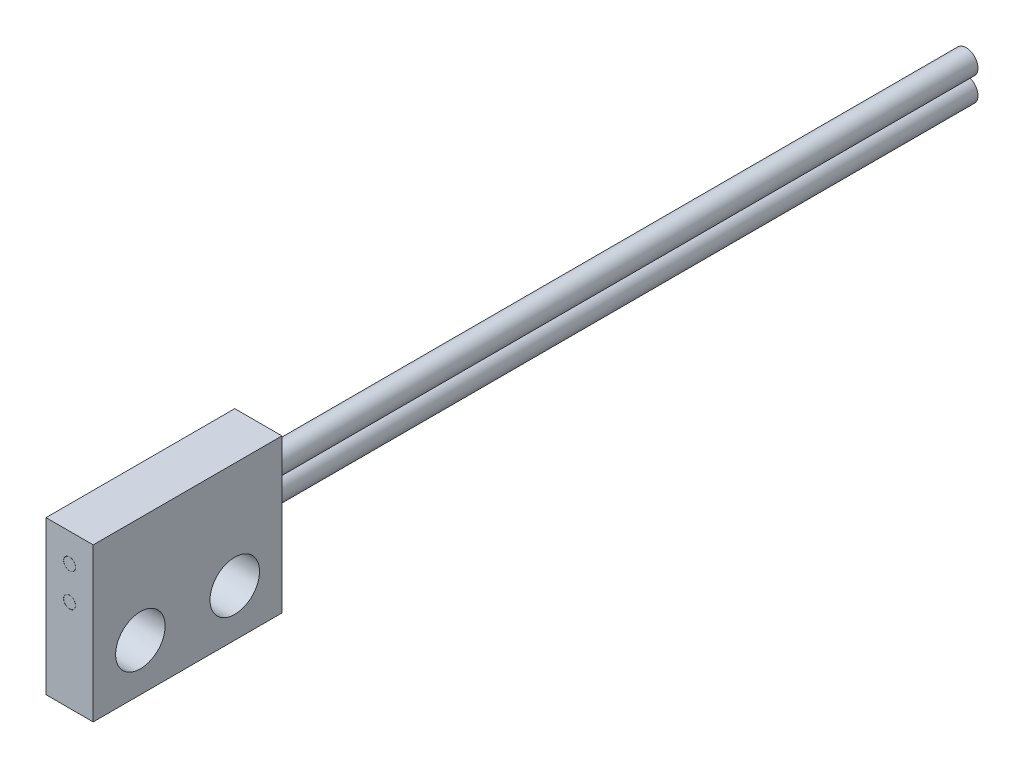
ISO-10303-21;
HEADER;
FILE_DESCRIPTION(('STEP AP214'),'2;1');
FILE_NAME('part.step','',(''),(''),'','','');
FILE_SCHEMA(('AUTOMOTIVE_DESIGN { 1 0 10303 214 1 1 1 1 }'));
ENDSEC;
DATA;
#1=APPLICATION_CONTEXT('core data for automotive mechanical design processes');
#2=APPLICATION_PROTOCOL_DEFINITION('international standard','automotive_design',2000,#1);
#3=PRODUCT_CONTEXT('',#1,'mechanical');
#4=PRODUCT('Part','Part','',(#3));
#5=PRODUCT_RELATED_PRODUCT_CATEGORY('part','',(#4));
#6=PRODUCT_DEFINITION_FORMATION('','',#4);
#7=PRODUCT_DEFINITION_CONTEXT('part definition',#1,'design');
#8=PRODUCT_DEFINITION('design','',#6,#7);
#9=PRODUCT_DEFINITION_SHAPE('','',#8);
#10=(LENGTH_UNIT() NAMED_UNIT(*) SI_UNIT(.MILLI.,.METRE.));
#11=(NAMED_UNIT(*) PLANE_ANGLE_UNIT() SI_UNIT($,.RADIAN.));
#12=(NAMED_UNIT(*) SI_UNIT($,.STERADIAN.) SOLID_ANGLE_UNIT());
#13=UNCERTAINTY_MEASURE_WITH_UNIT(LENGTH_MEASURE(1.E-05),#10,'distance_accuracy_value','');
#14=(GEOMETRIC_REPRESENTATION_CONTEXT(3) GLOBAL_UNCERTAINTY_ASSIGNED_CONTEXT((#13)) GLOBAL_UNIT_ASSIGNED_CONTEXT((#10,
#11,#12)) REPRESENTATION_CONTEXT('',''));
#15=CARTESIAN_POINT('',(0.,0.,0.));
#16=DIRECTION('',(0.,0.,1.));
#17=DIRECTION('',(1.,0.,0.));
#18=AXIS2_PLACEMENT_3D('',#15,#16,#17);
#19=CARTESIAN_POINT('',(1.,-3.25,4.00000000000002));
#20=DIRECTION('',(0.,0.,-1.));
#21=DIRECTION('',(-1.,0.,0.));
#22=AXIS2_PLACEMENT_3D('',#19,#20,#21);
#23=PLANE('',#22);
#24=CARTESIAN_POINT('',(0.,2.05,4.00000000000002));
#25=DIRECTION('',(0.,0.,1.));
#26=DIRECTION('',(1.,0.,0.));
#27=AXIS2_PLACEMENT_3D('',#24,#25,#26);
#28=CIRCLE('',#27,0.255);
#29=CARTESIAN_POINT('',(0.255,2.05,4.00000000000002));
#30=VERTEX_POINT('',#29);
#31=EDGE_CURVE('E180',#30,#30,#28,.T.);
#32=ORIENTED_EDGE('',*,*,#31,.F.);
#33=EDGE_LOOP('',(#32));
#34=FACE_BOUND('',#33,.T.);
#35=CARTESIAN_POINT('',(0.,0.649999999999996,4.00000000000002));
#36=DIRECTION('',(0.,0.,1.));
#37=DIRECTION('',(1.,0.,0.));
#38=AXIS2_PLACEMENT_3D('',#35,#36,#37);
#39=CIRCLE('',#38,0.255);
#40=CARTESIAN_POINT('',(0.255,0.649999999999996,4.00000000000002));
#41=VERTEX_POINT('',#40);
#42=EDGE_CURVE('E153',#41,#41,#39,.T.);
#43=ORIENTED_EDGE('',*,*,#42,.F.);
#44=EDGE_LOOP('',(#43));
#45=FACE_BOUND('',#44,.T.);
#46=DIRECTION('',(0.,-1.,0.));
#47=VECTOR('',#46,1.);
#48=CARTESIAN_POINT('',(-1.,-3.25,4.00000000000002));
#49=LINE('',#48,#47);
#50=CARTESIAN_POINT('',(-1.,3.25,4.00000000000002));
#51=VERTEX_POINT('',#50);
#52=CARTESIAN_POINT('',(-1.,-3.25,4.00000000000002));
#53=VERTEX_POINT('',#52);
#54=EDGE_CURVE('E102',#51,#53,#49,.T.);
#55=ORIENTED_EDGE('',*,*,#54,.T.);
#56=DIRECTION('',(-1.,0.,0.));
#57=VECTOR('',#56,1.);
#58=CARTESIAN_POINT('',(1.,-3.25,4.00000000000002));
#59=LINE('',#58,#57);
#60=CARTESIAN_POINT('',(1.,-3.25,4.00000000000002));
#61=VERTEX_POINT('',#60);
#62=EDGE_CURVE('E93',#61,#53,#59,.T.);
#63=ORIENTED_EDGE('',*,*,#62,.F.);
#64=DIRECTION('',(0.,-1.,0.));
#65=VECTOR('',#64,1.);
#66=CARTESIAN_POINT('',(1.,-3.25,4.00000000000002));
#67=LINE('',#66,#65);
#68=CARTESIAN_POINT('',(1.,3.25,4.00000000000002));
#69=VERTEX_POINT('',#68);
#70=EDGE_CURVE('E87',#69,#61,#67,.T.);
#71=ORIENTED_EDGE('',*,*,#70,.F.);
#72=DIRECTION('',(-1.,0.,0.));
#73=VECTOR('',#72,1.);
#74=CARTESIAN_POINT('',(1.,3.25,4.00000000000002));
#75=LINE('',#74,#73);
#76=EDGE_CURVE('E98',#69,#51,#75,.T.);
#77=ORIENTED_EDGE('',*,*,#76,.T.);
#78=EDGE_LOOP('',(#55,#63,#71,#77));
#79=FACE_BOUND('',#78,.T.);
#80=ADVANCED_FACE('F35',(#34,#45,#79),#23,.F.);
#81=CARTESIAN_POINT('',(1.,-3.24999999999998,-3.99999999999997));
#82=DIRECTION('',(0.,1.,0.));
#83=DIRECTION('',(0.,0.,1.));
#84=AXIS2_PLACEMENT_3D('',#81,#82,#83);
#85=PLANE('',#84);
#86=DIRECTION('',(0.,0.,-1.));
#87=VECTOR('',#86,1.);
#88=CARTESIAN_POINT('',(-1.,-3.24999999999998,-3.99999999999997));
#89=LINE('',#88,#87);
#90=CARTESIAN_POINT('',(-1.,-3.24999999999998,-3.99999999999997));
#91=VERTEX_POINT('',#90);
#92=EDGE_CURVE('E92',#53,#91,#89,.T.);
#93=ORIENTED_EDGE('',*,*,#92,.T.);
#94=DIRECTION('',(-1.,0.,0.));
#95=VECTOR('',#94,1.);
#96=CARTESIAN_POINT('',(1.,-3.24999999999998,-3.99999999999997));
#97=LINE('',#96,#95);
#98=CARTESIAN_POINT('',(1.,-3.24999999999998,-3.99999999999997));
#99=VERTEX_POINT('',#98);
#100=EDGE_CURVE('E90',#99,#91,#97,.T.);
#101=ORIENTED_EDGE('',*,*,#100,.F.);
#102=DIRECTION('',(0.,0.,-1.));
#103=VECTOR('',#102,1.);
#104=CARTESIAN_POINT('',(1.,-3.24999999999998,-3.99999999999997));
#105=LINE('',#104,#103);
#106=EDGE_CURVE('E82',#61,#99,#105,.T.);
#107=ORIENTED_EDGE('',*,*,#106,.F.);
#108=ORIENTED_EDGE('',*,*,#62,.T.);
#109=EDGE_LOOP('',(#93,#101,#107,#108));
#110=FACE_BOUND('',#109,.T.);
#111=ADVANCED_FACE('F91',(#110),#85,.F.);
#112=CARTESIAN_POINT('',(1.,-3.24999999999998,-3.99999999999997));
#113=DIRECTION('',(0.,0.,1.));
#114=DIRECTION('',(0.,-1.,0.));
#115=AXIS2_PLACEMENT_3D('',#112,#113,#114);
#116=PLANE('',#115);
#117=CARTESIAN_POINT('',(0.,0.489999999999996,-3.99999999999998));
#118=DIRECTION('',(0.,0.,1.));
#119=DIRECTION('',(0.,-1.,0.));
#120=AXIS2_PLACEMENT_3D('',#117,#118,#119);
#121=CIRCLE('',#120,0.5);
#122=CARTESIAN_POINT('',(0.,-0.010000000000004,-3.99999999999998));
#123=VERTEX_POINT('',#122);
#124=EDGE_CURVE('E11',#123,#123,#121,.F.);
#125=ORIENTED_EDGE('',*,*,#124,.F.);
#126=EDGE_LOOP('',(#125));
#127=FACE_BOUND('',#126,.T.);
#128=CARTESIAN_POINT('',(0.,1.5,-3.99999999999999));
#129=DIRECTION('',(0.,0.,1.));
#130=DIRECTION('',(0.,-1.,0.));
#131=AXIS2_PLACEMENT_3D('',#128,#129,#130);
#132=CIRCLE('',#131,0.5);
#133=CARTESIAN_POINT('',(0.,0.999999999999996,-3.99999999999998));
#134=VERTEX_POINT('',#133);
#135=EDGE_CURVE('E43',#134,#134,#132,.F.);
#136=ORIENTED_EDGE('',*,*,#135,.F.);
#137=EDGE_LOOP('',(#136));
#138=FACE_BOUND('',#137,.T.);
#139=DIRECTION('',(0.,1.,0.));
#140=VECTOR('',#139,1.);
#141=CARTESIAN_POINT('',(-1.,-3.24999999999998,-3.99999999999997));
#142=LINE('',#141,#140);
#143=CARTESIAN_POINT('',(-1.,3.25,-3.99999999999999));
#144=VERTEX_POINT('',#143);
#145=EDGE_CURVE('E68',#91,#144,#142,.T.);
#146=ORIENTED_EDGE('',*,*,#145,.T.);
#147=DIRECTION('',(-1.,0.,0.));
#148=VECTOR('',#147,1.);
#149=CARTESIAN_POINT('',(1.,3.25,-3.99999999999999));
#150=LINE('',#149,#148);
#151=CARTESIAN_POINT('',(1.,3.25,-3.99999999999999));
#152=VERTEX_POINT('',#151);
#153=EDGE_CURVE('E94',#152,#144,#150,.T.);
#154=ORIENTED_EDGE('',*,*,#153,.F.);
#155=DIRECTION('',(0.,1.,0.));
#156=VECTOR('',#155,1.);
#157=CARTESIAN_POINT('',(1.,-3.24999999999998,-3.99999999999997));
#158=LINE('',#157,#156);
#159=EDGE_CURVE('E85',#99,#152,#158,.T.);
#160=ORIENTED_EDGE('',*,*,#159,.F.);
#161=ORIENTED_EDGE('',*,*,#100,.T.);
#162=EDGE_LOOP('',(#146,#154,#160,#161));
#163=FACE_BOUND('',#162,.T.);
#164=ADVANCED_FACE('F96',(#127,#138,#163),#116,.F.);
#165=CARTESIAN_POINT('',(1.,3.25,-3.99999999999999));
#166=DIRECTION('',(0.,-1.,0.));
#167=DIRECTION('',(0.,0.,-1.));
#168=AXIS2_PLACEMENT_3D('',#165,#166,#167);
#169=PLANE('',#168);
#170=DIRECTION('',(0.,0.,1.));
#171=VECTOR('',#170,1.);
#172=CARTESIAN_POINT('',(-1.,3.25,-3.99999999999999));
#173=LINE('',#172,#171);
#174=EDGE_CURVE('E74',#144,#51,#173,.T.);
#175=ORIENTED_EDGE('',*,*,#174,.T.);
#176=ORIENTED_EDGE('',*,*,#76,.F.);
#177=DIRECTION('',(0.,0.,1.));
#178=VECTOR('',#177,1.);
#179=CARTESIAN_POINT('',(1.,3.25,-3.99999999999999));
#180=LINE('',#179,#178);
#181=EDGE_CURVE('E51',#152,#69,#180,.T.);
#182=ORIENTED_EDGE('',*,*,#181,.F.);
#183=ORIENTED_EDGE('',*,*,#153,.T.);
#184=EDGE_LOOP('',(#175,#176,#182,#183));
#185=FACE_BOUND('',#184,.T.);
#186=ADVANCED_FACE('F117',(#185),#169,.F.);
#187=CARTESIAN_POINT('',(1.,0.,0.));
#188=DIRECTION('',(1.,0.,0.));
#189=DIRECTION('',(0.,0.,-1.));
#190=AXIS2_PLACEMENT_3D('',#187,#188,#189);
#191=PLANE('',#190);
#192=CARTESIAN_POINT('',(1.,-1.25,2.00000000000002));
#193=DIRECTION('',(1.,0.,0.));
#194=DIRECTION('',(0.,0.,-1.));
#195=AXIS2_PLACEMENT_3D('',#192,#193,#194);
#196=CIRCLE('',#195,1.05);
#197=CARTESIAN_POINT('',(1.,-1.25,0.950000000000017));
#198=VERTEX_POINT('',#197);
#199=EDGE_CURVE('E168',#198,#198,#196,.T.);
#200=ORIENTED_EDGE('',*,*,#199,.F.);
#201=EDGE_LOOP('',(#200));
#202=FACE_BOUND('',#201,.T.);
#203=CARTESIAN_POINT('',(1.,-1.25,-1.99999999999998));
#204=DIRECTION('',(1.,0.,0.));
#205=DIRECTION('',(0.,0.,-1.));
#206=AXIS2_PLACEMENT_3D('',#203,#204,#205);
#207=CIRCLE('',#206,1.05);
#208=CARTESIAN_POINT('',(1.,-1.25,-3.04999999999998));
#209=VERTEX_POINT('',#208);
#210=EDGE_CURVE('E174',#209,#209,#207,.T.);
#211=ORIENTED_EDGE('',*,*,#210,.F.);
#212=EDGE_LOOP('',(#211));
#213=FACE_BOUND('',#212,.T.);
#214=ORIENTED_EDGE('',*,*,#70,.T.);
#215=ORIENTED_EDGE('',*,*,#106,.T.);
#216=ORIENTED_EDGE('',*,*,#159,.T.);
#217=ORIENTED_EDGE('',*,*,#181,.T.);
#218=EDGE_LOOP('',(#214,#215,#216,#217));
#219=FACE_BOUND('',#218,.T.);
#220=ADVANCED_FACE('F83',(#202,#213,#219),#191,.T.);
#221=CARTESIAN_POINT('',(-1.,0.,0.));
#222=DIRECTION('',(1.,0.,0.));
#223=DIRECTION('',(0.,0.,-1.));
#224=AXIS2_PLACEMENT_3D('',#221,#222,#223);
#225=PLANE('',#224);
#226=CARTESIAN_POINT('',(-1.,-1.25,2.00000000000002));
#227=DIRECTION('',(1.,0.,0.));
#228=DIRECTION('',(0.,0.,-1.));
#229=AXIS2_PLACEMENT_3D('',#226,#227,#228);
#230=CIRCLE('',#229,1.05);
#231=CARTESIAN_POINT('',(-1.,-1.25,0.950000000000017));
#232=VERTEX_POINT('',#231);
#233=EDGE_CURVE('E105',#232,#232,#230,.T.);
#234=ORIENTED_EDGE('',*,*,#233,.T.);
#235=EDGE_LOOP('',(#234));
#236=FACE_BOUND('',#235,.T.);
#237=CARTESIAN_POINT('',(-1.,-1.25,-1.99999999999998));
#238=DIRECTION('',(1.,0.,0.));
#239=DIRECTION('',(0.,0.,-1.));
#240=AXIS2_PLACEMENT_3D('',#237,#238,#239);
#241=CIRCLE('',#240,1.05);
#242=CARTESIAN_POINT('',(-1.,-1.25,-3.04999999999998));
#243=VERTEX_POINT('',#242);
#244=EDGE_CURVE('E171',#243,#243,#241,.T.);
#245=ORIENTED_EDGE('',*,*,#244,.T.);
#246=EDGE_LOOP('',(#245));
#247=FACE_BOUND('',#246,.T.);
#248=ORIENTED_EDGE('',*,*,#54,.F.);
#249=ORIENTED_EDGE('',*,*,#174,.F.);
#250=ORIENTED_EDGE('',*,*,#145,.F.);
#251=ORIENTED_EDGE('',*,*,#92,.F.);
#252=EDGE_LOOP('',(#248,#249,#250,#251));
#253=FACE_BOUND('',#252,.T.);
#254=ADVANCED_FACE('F238',(#236,#247,#253),#225,.F.);
#255=CARTESIAN_POINT('',(-1.,-1.25,-1.99999999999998));
#256=DIRECTION('',(1.,0.,0.));
#257=DIRECTION('',(0.,0.,-1.));
#258=AXIS2_PLACEMENT_3D('',#255,#256,#257);
#259=CYLINDRICAL_SURFACE('',#258,1.05);
#260=ORIENTED_EDGE('',*,*,#244,.F.);
#261=EDGE_LOOP('',(#260));
#262=FACE_BOUND('',#261,.T.);
#263=ORIENTED_EDGE('',*,*,#210,.T.);
#264=EDGE_LOOP('',(#263));
#265=FACE_BOUND('',#264,.T.);
#266=ADVANCED_FACE('F234',(#262,#265),#259,.F.);
#267=CARTESIAN_POINT('',(-1.,-1.25,2.00000000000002));
#268=DIRECTION('',(1.,0.,0.));
#269=DIRECTION('',(0.,0.,-1.));
#270=AXIS2_PLACEMENT_3D('',#267,#268,#269);
#271=CYLINDRICAL_SURFACE('',#270,1.05);
#272=ORIENTED_EDGE('',*,*,#233,.F.);
#273=EDGE_LOOP('',(#272));
#274=FACE_BOUND('',#273,.T.);
#275=ORIENTED_EDGE('',*,*,#199,.T.);
#276=EDGE_LOOP('',(#275));
#277=FACE_BOUND('',#276,.T.);
#278=ADVANCED_FACE('F230',(#274,#277),#271,.F.);
#279=CARTESIAN_POINT('',(0.,0.649999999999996,3.90000000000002));
#280=DIRECTION('',(0.,0.,1.));
#281=DIRECTION('',(1.,0.,0.));
#282=AXIS2_PLACEMENT_3D('',#279,#280,#281);
#283=CYLINDRICAL_SURFACE('',#282,0.255);
#284=CARTESIAN_POINT('',(0.,0.649999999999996,3.90000000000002));
#285=DIRECTION('',(0.,0.,1.));
#286=DIRECTION('',(1.,0.,0.));
#287=AXIS2_PLACEMENT_3D('',#284,#285,#286);
#288=CIRCLE('',#287,0.255);
#289=CARTESIAN_POINT('',(0.255,0.649999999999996,3.90000000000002));
#290=VERTEX_POINT('',#289);
#291=EDGE_CURVE('E160',#290,#290,#288,.T.);
#292=ORIENTED_EDGE('',*,*,#291,.F.);
#293=EDGE_LOOP('',(#292));
#294=FACE_BOUND('',#293,.T.);
#295=ORIENTED_EDGE('',*,*,#42,.T.);
#296=EDGE_LOOP('',(#295));
#297=FACE_BOUND('',#296,.T.);
#298=ADVANCED_FACE('F226',(#294,#297),#283,.F.);
#299=CARTESIAN_POINT('',(0.,0.649999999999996,3.90000000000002));
#300=DIRECTION('',(0.,0.,1.));
#301=DIRECTION('',(1.,0.,0.));
#302=AXIS2_PLACEMENT_3D('',#299,#300,#301);
#303=PLANE('',#302);
#304=CARTESIAN_POINT('',(0.,0.649999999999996,3.90000000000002));
#305=DIRECTION('',(0.,0.,1.));
#306=DIRECTION('',(1.,0.,0.));
#307=AXIS2_PLACEMENT_3D('',#304,#305,#306);
#308=CIRCLE('',#307,0.25);
#309=CARTESIAN_POINT('',(0.25,0.649999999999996,3.90000000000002));
#310=VERTEX_POINT('',#309);
#311=EDGE_CURVE('E149',#310,#310,#308,.T.);
#312=ORIENTED_EDGE('',*,*,#311,.F.);
#313=EDGE_LOOP('',(#312));
#314=FACE_BOUND('',#313,.T.);
#315=ORIENTED_EDGE('',*,*,#291,.T.);
#316=EDGE_LOOP('',(#315));
#317=FACE_BOUND('',#316,.T.);
#318=ADVANCED_FACE('F222',(#314,#317),#303,.T.);
#319=CARTESIAN_POINT('',(0.,0.649999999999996,3.90000000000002));
#320=DIRECTION('',(0.,0.,1.));
#321=DIRECTION('',(1.,0.,0.));
#322=AXIS2_PLACEMENT_3D('',#319,#320,#321);
#323=CYLINDRICAL_SURFACE('',#322,0.25);
#324=ORIENTED_EDGE('',*,*,#311,.T.);
#325=EDGE_LOOP('',(#324));
#326=FACE_BOUND('',#325,.T.);
#327=CARTESIAN_POINT('',(0.,0.649999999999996,4.00000000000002));
#328=DIRECTION('',(0.,0.,1.));
#329=DIRECTION('',(1.,0.,0.));
#330=AXIS2_PLACEMENT_3D('',#327,#328,#329);
#331=CIRCLE('',#330,0.25);
#332=CARTESIAN_POINT('',(0.25,0.649999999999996,4.00000000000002));
#333=VERTEX_POINT('',#332);
#334=EDGE_CURVE('E147',#333,#333,#331,.T.);
#335=ORIENTED_EDGE('',*,*,#334,.F.);
#336=EDGE_LOOP('',(#335));
#337=FACE_BOUND('',#336,.T.);
#338=ADVANCED_FACE('F218',(#326,#337),#323,.T.);
#339=CARTESIAN_POINT('',(0.,2.05,3.90000000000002));
#340=DIRECTION('',(0.,0.,1.));
#341=DIRECTION('',(1.,0.,0.));
#342=AXIS2_PLACEMENT_3D('',#339,#340,#341);
#343=CYLINDRICAL_SURFACE('',#342,0.255);
#344=CARTESIAN_POINT('',(0.,2.05,3.90000000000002));
#345=DIRECTION('',(0.,0.,1.));
#346=DIRECTION('',(1.,0.,0.));
#347=AXIS2_PLACEMENT_3D('',#344,#345,#346);
#348=CIRCLE('',#347,0.255);
#349=CARTESIAN_POINT('',(0.255,2.05,3.90000000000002));
#350=VERTEX_POINT('',#349);
#351=EDGE_CURVE('E176',#350,#350,#348,.T.);
#352=ORIENTED_EDGE('',*,*,#351,.F.);
#353=EDGE_LOOP('',(#352));
#354=FACE_BOUND('',#353,.T.);
#355=ORIENTED_EDGE('',*,*,#31,.T.);
#356=EDGE_LOOP('',(#355));
#357=FACE_BOUND('',#356,.T.);
#358=ADVANCED_FACE('F214',(#354,#357),#343,.F.);
#359=CARTESIAN_POINT('',(0.,2.05,3.90000000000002));
#360=DIRECTION('',(0.,0.,1.));
#361=DIRECTION('',(1.,0.,0.));
#362=AXIS2_PLACEMENT_3D('',#359,#360,#361);
#363=PLANE('',#362);
#364=CARTESIAN_POINT('',(0.,2.05,3.90000000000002));
#365=DIRECTION('',(0.,0.,1.));
#366=DIRECTION('',(1.,0.,0.));
#367=AXIS2_PLACEMENT_3D('',#364,#365,#366);
#368=CIRCLE('',#367,0.25);
#369=CARTESIAN_POINT('',(0.25,2.05,3.90000000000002));
#370=VERTEX_POINT('',#369);
#371=EDGE_CURVE('E185',#370,#370,#368,.T.);
#372=ORIENTED_EDGE('',*,*,#371,.F.);
#373=EDGE_LOOP('',(#372));
#374=FACE_BOUND('',#373,.T.);
#375=ORIENTED_EDGE('',*,*,#351,.T.);
#376=EDGE_LOOP('',(#375));
#377=FACE_BOUND('',#376,.T.);
#378=ADVANCED_FACE('F142',(#374,#377),#363,.T.);
#379=CARTESIAN_POINT('',(0.,2.05,3.90000000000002));
#380=DIRECTION('',(0.,0.,1.));
#381=DIRECTION('',(1.,0.,0.));
#382=AXIS2_PLACEMENT_3D('',#379,#380,#381);
#383=CYLINDRICAL_SURFACE('',#382,0.25);
#384=ORIENTED_EDGE('',*,*,#371,.T.);
#385=EDGE_LOOP('',(#384));
#386=FACE_BOUND('',#385,.T.);
#387=CARTESIAN_POINT('',(0.,2.05,4.00000000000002));
#388=DIRECTION('',(0.,0.,1.));
#389=DIRECTION('',(1.,0.,0.));
#390=AXIS2_PLACEMENT_3D('',#387,#388,#389);
#391=CIRCLE('',#390,0.25);
#392=CARTESIAN_POINT('',(0.25,2.05,4.00000000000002));
#393=VERTEX_POINT('',#392);
#394=EDGE_CURVE('E163',#393,#393,#391,.T.);
#395=ORIENTED_EDGE('',*,*,#394,.F.);
#396=EDGE_LOOP('',(#395));
#397=FACE_BOUND('',#396,.T.);
#398=ADVANCED_FACE('F137',(#386,#397),#383,.T.);
#399=ORIENTED_EDGE('',*,*,#334,.T.);
#400=EDGE_LOOP('',(#399));
#401=FACE_BOUND('',#400,.T.);
#402=ADVANCED_FACE('F129',(#401),#23,.F.);
#403=ORIENTED_EDGE('',*,*,#394,.T.);
#404=EDGE_LOOP('',(#403));
#405=FACE_BOUND('',#404,.T.);
#406=ADVANCED_FACE('F128',(#405),#23,.F.);
#407=CARTESIAN_POINT('',(0.,1.4999999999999,-34.));
#408=DIRECTION('',(0.,0.,1.));
#409=DIRECTION('',(0.,-1.,0.));
#410=AXIS2_PLACEMENT_3D('',#407,#408,#409);
#411=CYLINDRICAL_SURFACE('',#410,0.5);
#412=CARTESIAN_POINT('',(0.,1.4999999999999,-34.));
#413=DIRECTION('',(0.,0.,-1.));
#414=DIRECTION('',(0.,1.,0.));
#415=AXIS2_PLACEMENT_3D('',#412,#413,#414);
#416=CIRCLE('',#415,0.5);
#417=CARTESIAN_POINT('',(0.,1.9999999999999,-34.));
#418=VERTEX_POINT('',#417);
#419=EDGE_CURVE('E150',#418,#418,#416,.T.);
#420=ORIENTED_EDGE('',*,*,#419,.F.);
#421=EDGE_LOOP('',(#420));
#422=FACE_BOUND('',#421,.T.);
#423=ORIENTED_EDGE('',*,*,#135,.T.);
#424=EDGE_LOOP('',(#423));
#425=FACE_BOUND('',#424,.T.);
#426=ADVANCED_FACE('F114',(#422,#425),#411,.T.);
#427=CARTESIAN_POINT('',(0.,1.4999999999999,-34.));
#428=DIRECTION('',(0.,0.,-1.));
#429=DIRECTION('',(0.,1.,0.));
#430=AXIS2_PLACEMENT_3D('',#427,#428,#429);
#431=PLANE('',#430);
#432=ORIENTED_EDGE('',*,*,#419,.T.);
#433=EDGE_LOOP('',(#432));
#434=FACE_BOUND('',#433,.T.);
#435=ADVANCED_FACE('F199',(#434),#431,.T.);
#436=CARTESIAN_POINT('',(0.,0.489999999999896,-34.));
#437=DIRECTION('',(0.,0.,1.));
#438=DIRECTION('',(0.,-1.,0.));
#439=AXIS2_PLACEMENT_3D('',#436,#437,#438);
#440=CYLINDRICAL_SURFACE('',#439,0.5);
#441=CARTESIAN_POINT('',(0.,0.489999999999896,-34.));
#442=DIRECTION('',(0.,0.,-1.));
#443=DIRECTION('',(0.,1.,0.));
#444=AXIS2_PLACEMENT_3D('',#441,#442,#443);
#445=CIRCLE('',#444,0.5);
#446=CARTESIAN_POINT('',(0.,0.989999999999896,-34.));
#447=VERTEX_POINT('',#446);
#448=EDGE_CURVE('E156',#447,#447,#445,.T.);
#449=ORIENTED_EDGE('',*,*,#448,.F.);
#450=EDGE_LOOP('',(#449));
#451=FACE_BOUND('',#450,.T.);
#452=ORIENTED_EDGE('',*,*,#124,.T.);
#453=EDGE_LOOP('',(#452));
#454=FACE_BOUND('',#453,.T.);
#455=ADVANCED_FACE('F196',(#451,#454),#440,.T.);
#456=CARTESIAN_POINT('',(0.,0.489999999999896,-34.));
#457=DIRECTION('',(0.,0.,-1.));
#458=DIRECTION('',(0.,1.,0.));
#459=AXIS2_PLACEMENT_3D('',#456,#457,#458);
#460=PLANE('',#459);
#461=ORIENTED_EDGE('',*,*,#448,.T.);
#462=EDGE_LOOP('',(#461));
#463=FACE_BOUND('',#462,.T.);
#464=ADVANCED_FACE('F194',(#463),#460,.T.);
#465=CLOSED_SHELL('',(#80,#111,#164,#186,#220,#254,#266,#278,#298,#318,#338,#358,#378,#398,#402,
#406,#426,#435,#455,#464));
#466=MANIFOLD_SOLID_BREP('B2',#465);
#467=ADVANCED_BREP_SHAPE_REPRESENTATION('',(#18,#466),#14);
#468=SHAPE_DEFINITION_REPRESENTATION(#9,#467);
ENDSEC;
END-ISO-10303-21;
